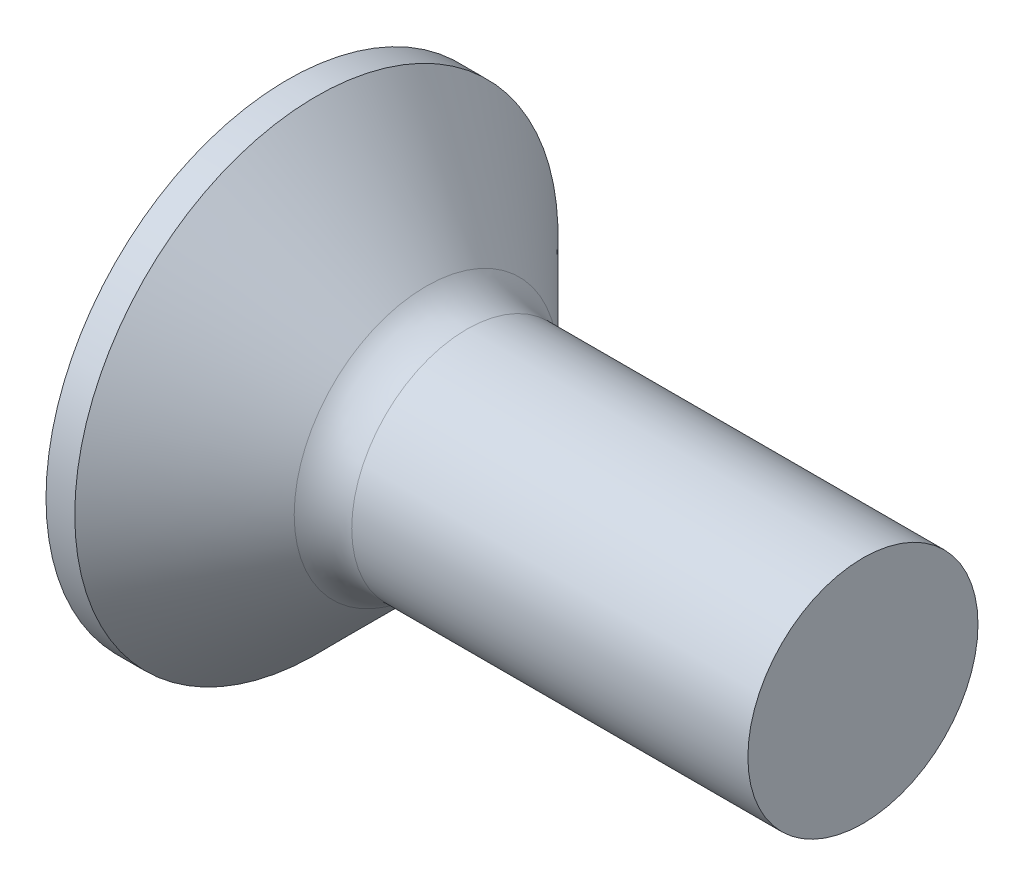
from build123d import *

# Parameters (mm, degrees)
FILLET1_R    = 1
RECPAT_COUNT = 2
RECPAT_ANGLE = 90


with BuildPart() as part:
    # BodySke → Base-Revolve (revolve)
    with BuildSketch(Plane.XY, mode=Mode.PRIVATE) as base_revolve_sk:
        Polygon((0, 0), (0, 4.2), (0.5, 4.2), (2.7, 2), (10, 2), (10, 0), align=None)
    revolve(base_revolve_sk.sketch.rotate(Axis((-6.35, 0, 0), (1, 0, 0)), 90), axis=Axis((-6.35, 0, 0), (1, 0, 0)))

    # Fillet1
    fillet1_edges = [part.edges().sort_by_distance(p)[0] for p in [
        (2.7, 0, -2),
    ]]
    fillet(fillet1_edges, radius=FILLET1_R)

    # Sketch3 → Recess section 0
    with BuildSketch(Plane.ZY):
        with BuildLine():
            Line((-0.515, 2.2), (0.515, 2.2))
            Line((0.515, 2.2), (0.515, -2.2))
            Line((0.515, -2.2), (-0.515, -2.2))
            Line((-0.515, -2.2), (-0.515, 2.2))
        make_face()
    # Sketch4 → Recess section 1
    with BuildSketch(Plane.ZY.offset(-2.51)):
        with BuildLine():
            Line((-0.515, 0.948560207), (0.515, 0.948560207))
            Line((0.515, 0.948560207), (0.515, -0.948560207))
            Line((0.515, -0.948560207), (-0.515, -0.948560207))
            Line((-0.515, -0.948560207), (-0.515, 0.948560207))
        make_face()
    recess = loft(mode=Mode.SUBTRACT)

    # RecPat: Recess ×2 about axis
    recpat_axis = Axis((0, 0, 0), (1, 0, 0))
    for i in range(1, RECPAT_COUNT):
        add(recess.rotate(recpat_axis, i * RECPAT_ANGLE / (RECPAT_COUNT - 1)), mode=Mode.SUBTRACT)

    # RecCorSke → RecessCore (revolve, cut)
    with BuildSketch(Plane.XY, mode=Mode.PRIVATE) as recesscore_sk:
        Polygon((0, 0), (0, 1.026516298), (2.51, 0.851), (2.786506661, 0), align=None)
    revolve(recesscore_sk.sketch.rotate(Axis((-3.175, 0, 0), (1, 0, 0)), 90), axis=Axis((-3.175, 0, 0), (1, 0, 0)), mode=Mode.SUBTRACT)


solid = part.part
